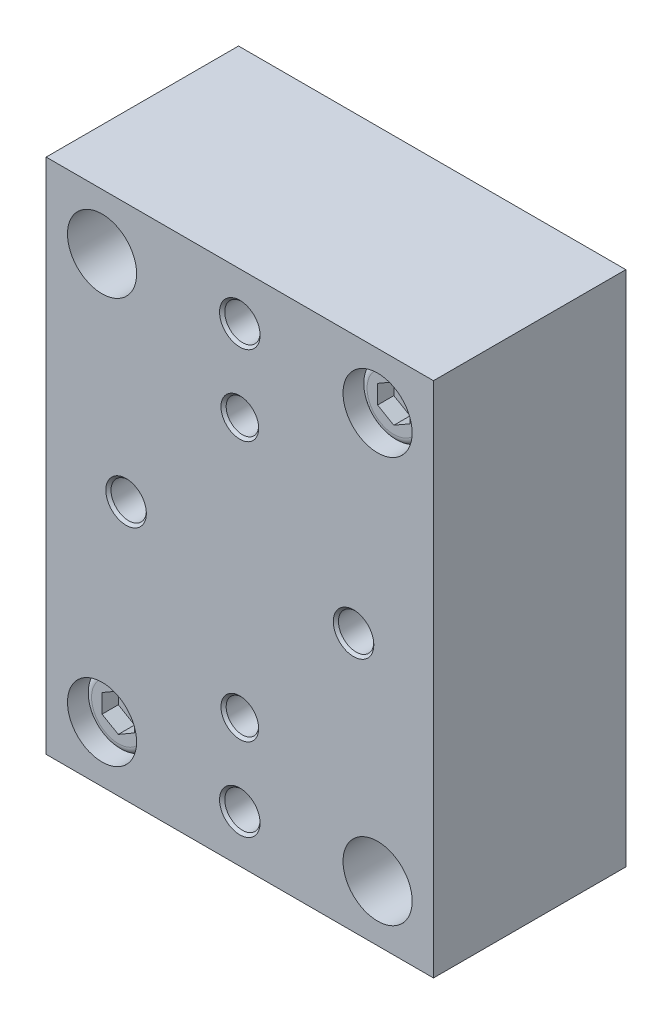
ISO-10303-21;
HEADER;
FILE_DESCRIPTION(('STEP AP214'),'2;1');
FILE_NAME('part.step','',(''),(''),'','','');
FILE_SCHEMA(('AUTOMOTIVE_DESIGN { 1 0 10303 214 1 1 1 1 }'));
ENDSEC;
DATA;
#1=APPLICATION_CONTEXT('core data for automotive mechanical design processes');
#2=APPLICATION_PROTOCOL_DEFINITION('international standard','automotive_design',2000,#1);
#3=PRODUCT_CONTEXT('',#1,'mechanical');
#4=PRODUCT('Part','Part','',(#3));
#5=PRODUCT_RELATED_PRODUCT_CATEGORY('part','',(#4));
#6=PRODUCT_DEFINITION_FORMATION('','',#4);
#7=PRODUCT_DEFINITION_CONTEXT('part definition',#1,'design');
#8=PRODUCT_DEFINITION('design','',#6,#7);
#9=PRODUCT_DEFINITION_SHAPE('','',#8);
#10=(LENGTH_UNIT() NAMED_UNIT(*) SI_UNIT(.MILLI.,.METRE.));
#11=(NAMED_UNIT(*) PLANE_ANGLE_UNIT() SI_UNIT($,.RADIAN.));
#12=(NAMED_UNIT(*) SI_UNIT($,.STERADIAN.) SOLID_ANGLE_UNIT());
#13=UNCERTAINTY_MEASURE_WITH_UNIT(LENGTH_MEASURE(1.E-05),#10,'distance_accuracy_value','');
#14=(GEOMETRIC_REPRESENTATION_CONTEXT(3) GLOBAL_UNCERTAINTY_ASSIGNED_CONTEXT((#13)) GLOBAL_UNIT_ASSIGNED_CONTEXT((#10,
#11,#12)) REPRESENTATION_CONTEXT('',''));
#15=CARTESIAN_POINT('',(0.,0.,0.));
#16=DIRECTION('',(0.,0.,1.));
#17=DIRECTION('',(1.,0.,0.));
#18=AXIS2_PLACEMENT_3D('',#15,#16,#17);
#19=CARTESIAN_POINT('',(-18.923,-25.273,17.2085));
#20=DIRECTION('',(0.,0.,1.));
#21=DIRECTION('',(1.,0.,0.));
#22=AXIS2_PLACEMENT_3D('',#19,#20,#21);
#23=PLANE('',#22);
#24=DIRECTION('',(-0.866025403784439,0.5,0.));
#25=VECTOR('',#24,1.);
#26=CARTESIAN_POINT('',(-11.8745,-18.8954564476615,17.2085));
#27=LINE('',#26,#25);
#28=CARTESIAN_POINT('',(-11.8745,-18.8954564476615,17.2085));
#29=VERTEX_POINT('',#28);
#30=CARTESIAN_POINT('',(-13.462,-17.9789128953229,17.2085));
#31=VERTEX_POINT('',#30);
#32=EDGE_CURVE('E61',#29,#31,#27,.T.);
#33=ORIENTED_EDGE('',*,*,#32,.F.);
#34=DIRECTION('',(0.,1.,0.));
#35=VECTOR('',#34,1.);
#36=CARTESIAN_POINT('',(-11.8745,-20.7285435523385,17.2085));
#37=LINE('',#36,#35);
#38=CARTESIAN_POINT('',(-11.8745,-20.7285435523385,17.2085));
#39=VERTEX_POINT('',#38);
#40=EDGE_CURVE('E144',#39,#29,#37,.T.);
#41=ORIENTED_EDGE('',*,*,#40,.F.);
#42=DIRECTION('',(0.866025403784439,0.5,0.));
#43=VECTOR('',#42,1.);
#44=CARTESIAN_POINT('',(-13.462,-21.6450871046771,17.2085));
#45=LINE('',#44,#43);
#46=CARTESIAN_POINT('',(-13.462,-21.6450871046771,17.2085));
#47=VERTEX_POINT('',#46);
#48=EDGE_CURVE('E142',#47,#39,#45,.T.);
#49=ORIENTED_EDGE('',*,*,#48,.F.);
#50=DIRECTION('',(0.866025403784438,-0.5,0.));
#51=VECTOR('',#50,1.);
#52=CARTESIAN_POINT('',(-15.0495,-20.7285435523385,17.2085));
#53=LINE('',#52,#51);
#54=CARTESIAN_POINT('',(-15.0495,-20.7285435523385,17.2085));
#55=VERTEX_POINT('',#54);
#56=EDGE_CURVE('E109',#55,#47,#53,.T.);
#57=ORIENTED_EDGE('',*,*,#56,.F.);
#58=DIRECTION('',(0.,-1.,0.));
#59=VECTOR('',#58,1.);
#60=CARTESIAN_POINT('',(-15.0495,-18.8954564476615,17.2085));
#61=LINE('',#60,#59);
#62=CARTESIAN_POINT('',(-15.0495,-18.8954564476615,17.2085));
#63=VERTEX_POINT('',#62);
#64=EDGE_CURVE('E138',#63,#55,#61,.T.);
#65=ORIENTED_EDGE('',*,*,#64,.F.);
#66=DIRECTION('',(-0.866025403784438,-0.5,0.));
#67=VECTOR('',#66,1.);
#68=CARTESIAN_POINT('',(-13.462,-17.9789128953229,17.2085));
#69=LINE('',#68,#67);
#70=EDGE_CURVE('E135',#31,#63,#69,.T.);
#71=ORIENTED_EDGE('',*,*,#70,.F.);
#72=EDGE_LOOP('',(#33,#41,#49,#57,#65,#71));
#73=FACE_BOUND('',#72,.T.);
#74=CARTESIAN_POINT('',(-13.462,-19.812,17.2085));
#75=DIRECTION('',(0.,0.,1.));
#76=DIRECTION('',(1.,0.,0.));
#77=AXIS2_PLACEMENT_3D('',#74,#75,#76);
#78=CIRCLE('',#77,2.6162);
#79=CARTESIAN_POINT('',(-10.8458,-19.812,17.2085));
#80=VERTEX_POINT('',#79);
#81=EDGE_CURVE('E12',#80,#80,#78,.T.);
#82=ORIENTED_EDGE('',*,*,#81,.T.);
#83=EDGE_LOOP('',(#82));
#84=FACE_BOUND('',#83,.T.);
#85=ADVANCED_FACE('F46',(#73,#84),#23,.T.);
#86=CARTESIAN_POINT('',(-13.462,-19.812,0.));
#87=DIRECTION('',(0.,0.,-1.));
#88=DIRECTION('',(-1.,0.,0.));
#89=AXIS2_PLACEMENT_3D('',#86,#87,#88);
#90=PLANE('',#89);
#91=CARTESIAN_POINT('',(-13.462,-19.812,0.));
#92=DIRECTION('',(0.,0.,-1.));
#93=DIRECTION('',(-1.,0.,0.));
#94=AXIS2_PLACEMENT_3D('',#91,#92,#93);
#95=CIRCLE('',#94,3.3782);
#96=CARTESIAN_POINT('',(-16.8402,-19.812,0.));
#97=VERTEX_POINT('',#96);
#98=EDGE_CURVE('E148',#97,#97,#95,.T.);
#99=ORIENTED_EDGE('',*,*,#98,.T.);
#100=EDGE_LOOP('',(#99));
#101=FACE_BOUND('',#100,.T.);
#102=ADVANCED_FACE('F170',(#101),#90,.T.);
#103=CARTESIAN_POINT('',(-13.462,-19.812,28.3509925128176));
#104=DIRECTION('',(0.,0.,-1.));
#105=DIRECTION('',(-1.,0.,0.));
#106=AXIS2_PLACEMENT_3D('',#103,#104,#105);
#107=CYLINDRICAL_SURFACE('',#106,3.3782);
#108=CARTESIAN_POINT('',(-13.462,-19.812,16.4465));
#109=DIRECTION('',(0.,0.,1.));
#110=DIRECTION('',(1.,0.,0.));
#111=AXIS2_PLACEMENT_3D('',#108,#109,#110);
#112=CIRCLE('',#111,3.3782);
#113=CARTESIAN_POINT('',(-10.0838,-19.812,16.4465));
#114=VERTEX_POINT('',#113);
#115=EDGE_CURVE('E54',#114,#114,#112,.F.);
#116=ORIENTED_EDGE('',*,*,#115,.T.);
#117=EDGE_LOOP('',(#116));
#118=FACE_BOUND('',#117,.T.);
#119=ORIENTED_EDGE('',*,*,#98,.F.);
#120=EDGE_LOOP('',(#119));
#121=FACE_BOUND('',#120,.T.);
#122=ADVANCED_FACE('F158',(#118,#121),#107,.T.);
#123=CARTESIAN_POINT('',(-13.462,-19.812,16.4465));
#124=DIRECTION('',(0.,0.,1.));
#125=DIRECTION('',(1.,0.,0.));
#126=AXIS2_PLACEMENT_3D('',#123,#124,#125);
#127=TOROIDAL_SURFACE('',#126,2.6162,0.762);
#128=ORIENTED_EDGE('',*,*,#81,.F.);
#129=EDGE_LOOP('',(#128));
#130=FACE_BOUND('',#129,.T.);
#131=ORIENTED_EDGE('',*,*,#115,.F.);
#132=EDGE_LOOP('',(#131));
#133=FACE_BOUND('',#132,.T.);
#134=ADVANCED_FACE('F48',(#130,#133),#127,.T.);
#135=CARTESIAN_POINT('',(-11.8745,-18.8954564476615,15.621));
#136=DIRECTION('',(0.5,0.866025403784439,0.));
#137=DIRECTION('',(-0.866025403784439,0.5,0.));
#138=AXIS2_PLACEMENT_3D('',#135,#136,#137);
#139=PLANE('',#138);
#140=ORIENTED_EDGE('',*,*,#32,.T.);
#141=DIRECTION('',(0.,0.,1.));
#142=VECTOR('',#141,1.);
#143=CARTESIAN_POINT('',(-13.462,-17.9789128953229,15.621));
#144=LINE('',#143,#142);
#145=CARTESIAN_POINT('',(-13.462,-17.9789128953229,15.621));
#146=VERTEX_POINT('',#145);
#147=EDGE_CURVE('E91',#146,#31,#144,.T.);
#148=ORIENTED_EDGE('',*,*,#147,.F.);
#149=DIRECTION('',(-0.866025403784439,0.5,0.));
#150=VECTOR('',#149,1.);
#151=CARTESIAN_POINT('',(-11.8745,-18.8954564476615,15.621));
#152=LINE('',#151,#150);
#153=CARTESIAN_POINT('',(-11.8745,-18.8954564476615,15.621));
#154=VERTEX_POINT('',#153);
#155=EDGE_CURVE('E146',#154,#146,#152,.T.);
#156=ORIENTED_EDGE('',*,*,#155,.F.);
#157=DIRECTION('',(0.,0.,1.));
#158=VECTOR('',#157,1.);
#159=CARTESIAN_POINT('',(-11.8745,-18.8954564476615,15.621));
#160=LINE('',#159,#158);
#161=EDGE_CURVE('E69',#154,#29,#160,.T.);
#162=ORIENTED_EDGE('',*,*,#161,.T.);
#163=EDGE_LOOP('',(#140,#148,#156,#162));
#164=FACE_BOUND('',#163,.T.);
#165=ADVANCED_FACE('F162',(#164),#139,.F.);
#166=CARTESIAN_POINT('',(-11.8745,-20.7285435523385,15.621));
#167=DIRECTION('',(1.,0.,0.));
#168=DIRECTION('',(0.,0.,-1.));
#169=AXIS2_PLACEMENT_3D('',#166,#167,#168);
#170=PLANE('',#169);
#171=ORIENTED_EDGE('',*,*,#40,.T.);
#172=ORIENTED_EDGE('',*,*,#161,.F.);
#173=DIRECTION('',(0.,1.,0.));
#174=VECTOR('',#173,1.);
#175=CARTESIAN_POINT('',(-11.8745,-20.7285435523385,15.621));
#176=LINE('',#175,#174);
#177=CARTESIAN_POINT('',(-11.8745,-20.7285435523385,15.621));
#178=VERTEX_POINT('',#177);
#179=EDGE_CURVE('E121',#178,#154,#176,.T.);
#180=ORIENTED_EDGE('',*,*,#179,.F.);
#181=DIRECTION('',(0.,0.,1.));
#182=VECTOR('',#181,1.);
#183=CARTESIAN_POINT('',(-11.8745,-20.7285435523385,15.621));
#184=LINE('',#183,#182);
#185=EDGE_CURVE('E113',#178,#39,#184,.T.);
#186=ORIENTED_EDGE('',*,*,#185,.T.);
#187=EDGE_LOOP('',(#171,#172,#180,#186));
#188=FACE_BOUND('',#187,.T.);
#189=ADVANCED_FACE('F168',(#188),#170,.F.);
#190=CARTESIAN_POINT('',(-13.462,-21.6450871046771,15.621));
#191=DIRECTION('',(0.5,-0.866025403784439,0.));
#192=DIRECTION('',(0.866025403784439,0.5,0.));
#193=AXIS2_PLACEMENT_3D('',#190,#191,#192);
#194=PLANE('',#193);
#195=ORIENTED_EDGE('',*,*,#48,.T.);
#196=ORIENTED_EDGE('',*,*,#185,.F.);
#197=DIRECTION('',(0.866025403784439,0.5,0.));
#198=VECTOR('',#197,1.);
#199=CARTESIAN_POINT('',(-13.462,-21.6450871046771,15.621));
#200=LINE('',#199,#198);
#201=CARTESIAN_POINT('',(-13.462,-21.6450871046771,15.621));
#202=VERTEX_POINT('',#201);
#203=EDGE_CURVE('E117',#202,#178,#200,.T.);
#204=ORIENTED_EDGE('',*,*,#203,.F.);
#205=DIRECTION('',(0.,0.,1.));
#206=VECTOR('',#205,1.);
#207=CARTESIAN_POINT('',(-13.462,-21.6450871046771,15.621));
#208=LINE('',#207,#206);
#209=EDGE_CURVE('E102',#202,#47,#208,.T.);
#210=ORIENTED_EDGE('',*,*,#209,.T.);
#211=EDGE_LOOP('',(#195,#196,#204,#210));
#212=FACE_BOUND('',#211,.T.);
#213=ADVANCED_FACE('F118',(#212),#194,.F.);
#214=CARTESIAN_POINT('',(-15.0495,-20.7285435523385,15.621));
#215=DIRECTION('',(-0.5,-0.866025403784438,0.));
#216=DIRECTION('',(0.866025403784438,-0.5,0.));
#217=AXIS2_PLACEMENT_3D('',#214,#215,#216);
#218=PLANE('',#217);
#219=ORIENTED_EDGE('',*,*,#56,.T.);
#220=ORIENTED_EDGE('',*,*,#209,.F.);
#221=DIRECTION('',(0.866025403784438,-0.5,0.));
#222=VECTOR('',#221,1.);
#223=CARTESIAN_POINT('',(-15.0495,-20.7285435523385,15.621));
#224=LINE('',#223,#222);
#225=CARTESIAN_POINT('',(-15.0495,-20.7285435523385,15.621));
#226=VERTEX_POINT('',#225);
#227=EDGE_CURVE('E106',#226,#202,#224,.T.);
#228=ORIENTED_EDGE('',*,*,#227,.F.);
#229=DIRECTION('',(0.,0.,1.));
#230=VECTOR('',#229,1.);
#231=CARTESIAN_POINT('',(-15.0495,-20.7285435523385,15.621));
#232=LINE('',#231,#230);
#233=EDGE_CURVE('E114',#226,#55,#232,.T.);
#234=ORIENTED_EDGE('',*,*,#233,.T.);
#235=EDGE_LOOP('',(#219,#220,#228,#234));
#236=FACE_BOUND('',#235,.T.);
#237=ADVANCED_FACE('F104',(#236),#218,.F.);
#238=CARTESIAN_POINT('',(-15.0495,-18.8954564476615,15.621));
#239=DIRECTION('',(-1.,0.,0.));
#240=DIRECTION('',(0.,0.,1.));
#241=AXIS2_PLACEMENT_3D('',#238,#239,#240);
#242=PLANE('',#241);
#243=ORIENTED_EDGE('',*,*,#64,.T.);
#244=ORIENTED_EDGE('',*,*,#233,.F.);
#245=DIRECTION('',(0.,-1.,0.));
#246=VECTOR('',#245,1.);
#247=CARTESIAN_POINT('',(-15.0495,-18.8954564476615,15.621));
#248=LINE('',#247,#246);
#249=CARTESIAN_POINT('',(-15.0495,-18.8954564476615,15.621));
#250=VERTEX_POINT('',#249);
#251=EDGE_CURVE('E127',#250,#226,#248,.T.);
#252=ORIENTED_EDGE('',*,*,#251,.F.);
#253=DIRECTION('',(0.,0.,1.));
#254=VECTOR('',#253,1.);
#255=CARTESIAN_POINT('',(-15.0495,-18.8954564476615,15.621));
#256=LINE('',#255,#254);
#257=EDGE_CURVE('E151',#250,#63,#256,.T.);
#258=ORIENTED_EDGE('',*,*,#257,.T.);
#259=EDGE_LOOP('',(#243,#244,#252,#258));
#260=FACE_BOUND('',#259,.T.);
#261=ADVANCED_FACE('F185',(#260),#242,.F.);
#262=CARTESIAN_POINT('',(-13.462,-17.9789128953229,15.621));
#263=DIRECTION('',(-0.5,0.866025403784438,0.));
#264=DIRECTION('',(-0.866025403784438,-0.5,0.));
#265=AXIS2_PLACEMENT_3D('',#262,#263,#264);
#266=PLANE('',#265);
#267=ORIENTED_EDGE('',*,*,#70,.T.);
#268=ORIENTED_EDGE('',*,*,#257,.F.);
#269=DIRECTION('',(-0.866025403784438,-0.5,0.));
#270=VECTOR('',#269,1.);
#271=CARTESIAN_POINT('',(-13.462,-17.9789128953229,15.621));
#272=LINE('',#271,#270);
#273=EDGE_CURVE('E129',#146,#250,#272,.T.);
#274=ORIENTED_EDGE('',*,*,#273,.F.);
#275=ORIENTED_EDGE('',*,*,#147,.T.);
#276=EDGE_LOOP('',(#267,#268,#274,#275));
#277=FACE_BOUND('',#276,.T.);
#278=ADVANCED_FACE('F182',(#277),#266,.F.);
#279=CARTESIAN_POINT('',(0.,0.,15.621));
#280=DIRECTION('',(0.,0.,1.));
#281=DIRECTION('',(1.,0.,0.));
#282=AXIS2_PLACEMENT_3D('',#279,#280,#281);
#283=PLANE('',#282);
#284=ORIENTED_EDGE('',*,*,#155,.T.);
#285=ORIENTED_EDGE('',*,*,#273,.T.);
#286=ORIENTED_EDGE('',*,*,#251,.T.);
#287=ORIENTED_EDGE('',*,*,#227,.T.);
#288=ORIENTED_EDGE('',*,*,#203,.T.);
#289=ORIENTED_EDGE('',*,*,#179,.T.);
#290=EDGE_LOOP('',(#284,#285,#286,#287,#288,#289));
#291=FACE_BOUND('',#290,.T.);
#292=ADVANCED_FACE('F124',(#291),#283,.T.);
#293=CLOSED_SHELL('',(#85,#102,#122,#134,#165,#189,#213,#237,#261,#278,#292));
#294=MANIFOLD_SOLID_BREP('B2',#293);
#295=CARTESIAN_POINT('',(-18.923,-25.273,17.2085));
#296=DIRECTION('',(0.,0.,1.));
#297=DIRECTION('',(1.,0.,0.));
#298=AXIS2_PLACEMENT_3D('',#295,#296,#297);
#299=PLANE('',#298);
#300=DIRECTION('',(-0.866025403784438,0.5,0.));
#301=VECTOR('',#300,1.);
#302=CARTESIAN_POINT('',(15.0495,20.7285435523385,17.2085));
#303=LINE('',#302,#301);
#304=CARTESIAN_POINT('',(15.0495,20.7285435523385,17.2085));
#305=VERTEX_POINT('',#304);
#306=CARTESIAN_POINT('',(13.462,21.6450871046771,17.2085));
#307=VERTEX_POINT('',#306);
#308=EDGE_CURVE('E292',#305,#307,#303,.T.);
#309=ORIENTED_EDGE('',*,*,#308,.F.);
#310=DIRECTION('',(0.,1.,0.));
#311=VECTOR('',#310,1.);
#312=CARTESIAN_POINT('',(15.0495,18.8954564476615,17.2085));
#313=LINE('',#312,#311);
#314=CARTESIAN_POINT('',(15.0495,18.8954564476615,17.2085));
#315=VERTEX_POINT('',#314);
#316=EDGE_CURVE('E375',#315,#305,#313,.T.);
#317=ORIENTED_EDGE('',*,*,#316,.F.);
#318=DIRECTION('',(0.866025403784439,0.499999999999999,0.));
#319=VECTOR('',#318,1.);
#320=CARTESIAN_POINT('',(13.462,17.9789128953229,17.2085));
#321=LINE('',#320,#319);
#322=CARTESIAN_POINT('',(13.462,17.9789128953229,17.2085));
#323=VERTEX_POINT('',#322);
#324=EDGE_CURVE('E373',#323,#315,#321,.T.);
#325=ORIENTED_EDGE('',*,*,#324,.F.);
#326=DIRECTION('',(0.866025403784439,-0.499999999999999,0.));
#327=VECTOR('',#326,1.);
#328=CARTESIAN_POINT('',(11.8745,18.8954564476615,17.2085));
#329=LINE('',#328,#327);
#330=CARTESIAN_POINT('',(11.8745,18.8954564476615,17.2085));
#331=VERTEX_POINT('',#330);
#332=EDGE_CURVE('E340',#331,#323,#329,.T.);
#333=ORIENTED_EDGE('',*,*,#332,.F.);
#334=DIRECTION('',(0.,-1.,0.));
#335=VECTOR('',#334,1.);
#336=CARTESIAN_POINT('',(11.8745,20.7285435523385,17.2085));
#337=LINE('',#336,#335);
#338=CARTESIAN_POINT('',(11.8745,20.7285435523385,17.2085));
#339=VERTEX_POINT('',#338);
#340=EDGE_CURVE('E369',#339,#331,#337,.T.);
#341=ORIENTED_EDGE('',*,*,#340,.F.);
#342=DIRECTION('',(-0.866025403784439,-0.5,0.));
#343=VECTOR('',#342,1.);
#344=CARTESIAN_POINT('',(13.462,21.6450871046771,17.2085));
#345=LINE('',#344,#343);
#346=EDGE_CURVE('E366',#307,#339,#345,.T.);
#347=ORIENTED_EDGE('',*,*,#346,.F.);
#348=EDGE_LOOP('',(#309,#317,#325,#333,#341,#347));
#349=FACE_BOUND('',#348,.T.);
#350=CARTESIAN_POINT('',(13.462,19.812,17.2085));
#351=DIRECTION('',(0.,0.,1.));
#352=DIRECTION('',(1.,0.,0.));
#353=AXIS2_PLACEMENT_3D('',#350,#351,#352);
#354=CIRCLE('',#353,2.6162);
#355=CARTESIAN_POINT('',(16.0782,19.812,17.2085));
#356=VERTEX_POINT('',#355);
#357=EDGE_CURVE('E44',#356,#356,#354,.T.);
#358=ORIENTED_EDGE('',*,*,#357,.T.);
#359=EDGE_LOOP('',(#358));
#360=FACE_BOUND('',#359,.T.);
#361=ADVANCED_FACE('F277',(#349,#360),#299,.T.);
#362=CARTESIAN_POINT('',(13.462,19.812,0.));
#363=DIRECTION('',(0.,0.,-1.));
#364=DIRECTION('',(-1.,0.,0.));
#365=AXIS2_PLACEMENT_3D('',#362,#363,#364);
#366=PLANE('',#365);
#367=CARTESIAN_POINT('',(13.462,19.812,0.));
#368=DIRECTION('',(0.,0.,-1.));
#369=DIRECTION('',(-1.,0.,0.));
#370=AXIS2_PLACEMENT_3D('',#367,#368,#369);
#371=CIRCLE('',#370,3.3782);
#372=CARTESIAN_POINT('',(10.0838,19.812,0.));
#373=VERTEX_POINT('',#372);
#374=EDGE_CURVE('E379',#373,#373,#371,.T.);
#375=ORIENTED_EDGE('',*,*,#374,.T.);
#376=EDGE_LOOP('',(#375));
#377=FACE_BOUND('',#376,.T.);
#378=ADVANCED_FACE('F401',(#377),#366,.T.);
#379=CARTESIAN_POINT('',(13.462,19.812,28.3509925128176));
#380=DIRECTION('',(0.,0.,-1.));
#381=DIRECTION('',(-1.,0.,0.));
#382=AXIS2_PLACEMENT_3D('',#379,#380,#381);
#383=CYLINDRICAL_SURFACE('',#382,3.3782);
#384=CARTESIAN_POINT('',(13.462,19.812,16.4465));
#385=DIRECTION('',(0.,0.,1.));
#386=DIRECTION('',(1.,0.,0.));
#387=AXIS2_PLACEMENT_3D('',#384,#385,#386);
#388=CIRCLE('',#387,3.3782);
#389=CARTESIAN_POINT('',(16.8402,19.812,16.4465));
#390=VERTEX_POINT('',#389);
#391=EDGE_CURVE('E285',#390,#390,#388,.F.);
#392=ORIENTED_EDGE('',*,*,#391,.T.);
#393=EDGE_LOOP('',(#392));
#394=FACE_BOUND('',#393,.T.);
#395=ORIENTED_EDGE('',*,*,#374,.F.);
#396=EDGE_LOOP('',(#395));
#397=FACE_BOUND('',#396,.T.);
#398=ADVANCED_FACE('F389',(#394,#397),#383,.T.);
#399=CARTESIAN_POINT('',(13.462,19.812,16.4465));
#400=DIRECTION('',(0.,0.,1.));
#401=DIRECTION('',(1.,0.,0.));
#402=AXIS2_PLACEMENT_3D('',#399,#400,#401);
#403=TOROIDAL_SURFACE('',#402,2.6162,0.762);
#404=ORIENTED_EDGE('',*,*,#357,.F.);
#405=EDGE_LOOP('',(#404));
#406=FACE_BOUND('',#405,.T.);
#407=ORIENTED_EDGE('',*,*,#391,.F.);
#408=EDGE_LOOP('',(#407));
#409=FACE_BOUND('',#408,.T.);
#410=ADVANCED_FACE('F279',(#406,#409),#403,.T.);
#411=CARTESIAN_POINT('',(15.0495,20.7285435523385,15.621));
#412=DIRECTION('',(0.5,0.866025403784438,0.));
#413=DIRECTION('',(-0.866025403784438,0.5,0.));
#414=AXIS2_PLACEMENT_3D('',#411,#412,#413);
#415=PLANE('',#414);
#416=ORIENTED_EDGE('',*,*,#308,.T.);
#417=DIRECTION('',(0.,0.,1.));
#418=VECTOR('',#417,1.);
#419=CARTESIAN_POINT('',(13.462,21.6450871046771,15.621));
#420=LINE('',#419,#418);
#421=CARTESIAN_POINT('',(13.462,21.6450871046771,15.621));
#422=VERTEX_POINT('',#421);
#423=EDGE_CURVE('E322',#422,#307,#420,.T.);
#424=ORIENTED_EDGE('',*,*,#423,.F.);
#425=DIRECTION('',(-0.866025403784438,0.5,0.));
#426=VECTOR('',#425,1.);
#427=CARTESIAN_POINT('',(15.0495,20.7285435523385,15.621));
#428=LINE('',#427,#426);
#429=CARTESIAN_POINT('',(15.0495,20.7285435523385,15.621));
#430=VERTEX_POINT('',#429);
#431=EDGE_CURVE('E377',#430,#422,#428,.T.);
#432=ORIENTED_EDGE('',*,*,#431,.F.);
#433=DIRECTION('',(0.,0.,1.));
#434=VECTOR('',#433,1.);
#435=CARTESIAN_POINT('',(15.0495,20.7285435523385,15.621));
#436=LINE('',#435,#434);
#437=EDGE_CURVE('E300',#430,#305,#436,.T.);
#438=ORIENTED_EDGE('',*,*,#437,.T.);
#439=EDGE_LOOP('',(#416,#424,#432,#438));
#440=FACE_BOUND('',#439,.T.);
#441=ADVANCED_FACE('F393',(#440),#415,.F.);
#442=CARTESIAN_POINT('',(15.0495,18.8954564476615,15.621));
#443=DIRECTION('',(1.,0.,0.));
#444=DIRECTION('',(0.,0.,-1.));
#445=AXIS2_PLACEMENT_3D('',#442,#443,#444);
#446=PLANE('',#445);
#447=ORIENTED_EDGE('',*,*,#316,.T.);
#448=ORIENTED_EDGE('',*,*,#437,.F.);
#449=DIRECTION('',(0.,1.,0.));
#450=VECTOR('',#449,1.);
#451=CARTESIAN_POINT('',(15.0495,18.8954564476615,15.621));
#452=LINE('',#451,#450);
#453=CARTESIAN_POINT('',(15.0495,18.8954564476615,15.621));
#454=VERTEX_POINT('',#453);
#455=EDGE_CURVE('E352',#454,#430,#452,.T.);
#456=ORIENTED_EDGE('',*,*,#455,.F.);
#457=DIRECTION('',(0.,0.,1.));
#458=VECTOR('',#457,1.);
#459=CARTESIAN_POINT('',(15.0495,18.8954564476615,15.621));
#460=LINE('',#459,#458);
#461=EDGE_CURVE('E344',#454,#315,#460,.T.);
#462=ORIENTED_EDGE('',*,*,#461,.T.);
#463=EDGE_LOOP('',(#447,#448,#456,#462));
#464=FACE_BOUND('',#463,.T.);
#465=ADVANCED_FACE('F399',(#464),#446,.F.);
#466=CARTESIAN_POINT('',(13.462,17.9789128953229,15.621));
#467=DIRECTION('',(0.499999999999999,-0.866025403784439,0.));
#468=DIRECTION('',(0.86602540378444,0.499999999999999,0.));
#469=AXIS2_PLACEMENT_3D('',#466,#467,#468);
#470=PLANE('',#469);
#471=ORIENTED_EDGE('',*,*,#324,.T.);
#472=ORIENTED_EDGE('',*,*,#461,.F.);
#473=DIRECTION('',(0.866025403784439,0.499999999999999,0.));
#474=VECTOR('',#473,1.);
#475=CARTESIAN_POINT('',(13.462,17.9789128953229,15.621));
#476=LINE('',#475,#474);
#477=CARTESIAN_POINT('',(13.462,17.9789128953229,15.621));
#478=VERTEX_POINT('',#477);
#479=EDGE_CURVE('E348',#478,#454,#476,.T.);
#480=ORIENTED_EDGE('',*,*,#479,.F.);
#481=DIRECTION('',(0.,0.,1.));
#482=VECTOR('',#481,1.);
#483=CARTESIAN_POINT('',(13.462,17.9789128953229,15.621));
#484=LINE('',#483,#482);
#485=EDGE_CURVE('E333',#478,#323,#484,.T.);
#486=ORIENTED_EDGE('',*,*,#485,.T.);
#487=EDGE_LOOP('',(#471,#472,#480,#486));
#488=FACE_BOUND('',#487,.T.);
#489=ADVANCED_FACE('F349',(#488),#470,.F.);
#490=CARTESIAN_POINT('',(11.8745,18.8954564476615,15.621));
#491=DIRECTION('',(-0.499999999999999,-0.866025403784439,0.));
#492=DIRECTION('',(0.866025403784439,-0.499999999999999,0.));
#493=AXIS2_PLACEMENT_3D('',#490,#491,#492);
#494=PLANE('',#493);
#495=ORIENTED_EDGE('',*,*,#332,.T.);
#496=ORIENTED_EDGE('',*,*,#485,.F.);
#497=DIRECTION('',(0.866025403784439,-0.499999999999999,0.));
#498=VECTOR('',#497,1.);
#499=CARTESIAN_POINT('',(11.8745,18.8954564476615,15.621));
#500=LINE('',#499,#498);
#501=CARTESIAN_POINT('',(11.8745,18.8954564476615,15.621));
#502=VERTEX_POINT('',#501);
#503=EDGE_CURVE('E337',#502,#478,#500,.T.);
#504=ORIENTED_EDGE('',*,*,#503,.F.);
#505=DIRECTION('',(0.,0.,1.));
#506=VECTOR('',#505,1.);
#507=CARTESIAN_POINT('',(11.8745,18.8954564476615,15.621));
#508=LINE('',#507,#506);
#509=EDGE_CURVE('E345',#502,#331,#508,.T.);
#510=ORIENTED_EDGE('',*,*,#509,.T.);
#511=EDGE_LOOP('',(#495,#496,#504,#510));
#512=FACE_BOUND('',#511,.T.);
#513=ADVANCED_FACE('F335',(#512),#494,.F.);
#514=CARTESIAN_POINT('',(11.8745,20.7285435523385,15.621));
#515=DIRECTION('',(-1.,0.,0.));
#516=DIRECTION('',(0.,0.,1.));
#517=AXIS2_PLACEMENT_3D('',#514,#515,#516);
#518=PLANE('',#517);
#519=ORIENTED_EDGE('',*,*,#340,.T.);
#520=ORIENTED_EDGE('',*,*,#509,.F.);
#521=DIRECTION('',(0.,-1.,0.));
#522=VECTOR('',#521,1.);
#523=CARTESIAN_POINT('',(11.8745,20.7285435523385,15.621));
#524=LINE('',#523,#522);
#525=CARTESIAN_POINT('',(11.8745,20.7285435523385,15.621));
#526=VERTEX_POINT('',#525);
#527=EDGE_CURVE('E358',#526,#502,#524,.T.);
#528=ORIENTED_EDGE('',*,*,#527,.F.);
#529=DIRECTION('',(0.,0.,1.));
#530=VECTOR('',#529,1.);
#531=CARTESIAN_POINT('',(11.8745,20.7285435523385,15.621));
#532=LINE('',#531,#530);
#533=EDGE_CURVE('E382',#526,#339,#532,.T.);
#534=ORIENTED_EDGE('',*,*,#533,.T.);
#535=EDGE_LOOP('',(#519,#520,#528,#534));
#536=FACE_BOUND('',#535,.T.);
#537=ADVANCED_FACE('F416',(#536),#518,.F.);
#538=CARTESIAN_POINT('',(13.462,21.6450871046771,15.621));
#539=DIRECTION('',(-0.5,0.866025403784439,0.));
#540=DIRECTION('',(-0.866025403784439,-0.5,0.));
#541=AXIS2_PLACEMENT_3D('',#538,#539,#540);
#542=PLANE('',#541);
#543=ORIENTED_EDGE('',*,*,#346,.T.);
#544=ORIENTED_EDGE('',*,*,#533,.F.);
#545=DIRECTION('',(-0.866025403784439,-0.5,0.));
#546=VECTOR('',#545,1.);
#547=CARTESIAN_POINT('',(13.462,21.6450871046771,15.621));
#548=LINE('',#547,#546);
#549=EDGE_CURVE('E360',#422,#526,#548,.T.);
#550=ORIENTED_EDGE('',*,*,#549,.F.);
#551=ORIENTED_EDGE('',*,*,#423,.T.);
#552=EDGE_LOOP('',(#543,#544,#550,#551));
#553=FACE_BOUND('',#552,.T.);
#554=ADVANCED_FACE('F413',(#553),#542,.F.);
#555=CARTESIAN_POINT('',(0.,0.,15.621));
#556=DIRECTION('',(0.,0.,1.));
#557=DIRECTION('',(1.,0.,0.));
#558=AXIS2_PLACEMENT_3D('',#555,#556,#557);
#559=PLANE('',#558);
#560=ORIENTED_EDGE('',*,*,#431,.T.);
#561=ORIENTED_EDGE('',*,*,#549,.T.);
#562=ORIENTED_EDGE('',*,*,#527,.T.);
#563=ORIENTED_EDGE('',*,*,#503,.T.);
#564=ORIENTED_EDGE('',*,*,#479,.T.);
#565=ORIENTED_EDGE('',*,*,#455,.T.);
#566=EDGE_LOOP('',(#560,#561,#562,#563,#564,#565));
#567=FACE_BOUND('',#566,.T.);
#568=ADVANCED_FACE('F355',(#567),#559,.T.);
#569=CLOSED_SHELL('',(#361,#378,#398,#410,#441,#465,#489,#513,#537,#554,#568));
#570=MANIFOLD_SOLID_BREP('B6',#569);
#571=CARTESIAN_POINT('',(-18.923,-25.273,0.));
#572=DIRECTION('',(0.,0.,1.));
#573=DIRECTION('',(1.,0.,0.));
#574=AXIS2_PLACEMENT_3D('',#571,#572,#573);
#575=PLANE('',#574);
#576=CARTESIAN_POINT('',(-11.1125,0.,0.));
#577=DIRECTION('',(0.,0.,1.));
#578=DIRECTION('',(1.,0.,0.));
#579=AXIS2_PLACEMENT_3D('',#576,#577,#578);
#580=CIRCLE('',#579,1.7272);
#581=CARTESIAN_POINT('',(-9.3853,0.,0.));
#582=VERTEX_POINT('',#581);
#583=EDGE_CURVE('E801',#582,#582,#580,.T.);
#584=ORIENTED_EDGE('',*,*,#583,.T.);
#585=EDGE_LOOP('',(#584));
#586=FACE_BOUND('',#585,.T.);
#587=CARTESIAN_POINT('',(11.1125,0.,0.));
#588=DIRECTION('',(0.,0.,1.));
#589=DIRECTION('',(1.,0.,0.));
#590=AXIS2_PLACEMENT_3D('',#587,#588,#589);
#591=CIRCLE('',#590,1.7272);
#592=CARTESIAN_POINT('',(12.8397,0.,0.));
#593=VERTEX_POINT('',#592);
#594=EDGE_CURVE('E683',#593,#593,#591,.T.);
#595=ORIENTED_EDGE('',*,*,#594,.T.);
#596=EDGE_LOOP('',(#595));
#597=FACE_BOUND('',#596,.T.);
#598=CARTESIAN_POINT('',(0.,20.6375,0.));
#599=DIRECTION('',(0.,0.,1.));
#600=DIRECTION('',(1.,0.,0.));
#601=AXIS2_PLACEMENT_3D('',#598,#599,#600);
#602=CIRCLE('',#601,1.7272);
#603=CARTESIAN_POINT('',(1.72719999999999,20.6375,0.));
#604=VERTEX_POINT('',#603);
#605=EDGE_CURVE('E677',#604,#604,#602,.T.);
#606=ORIENTED_EDGE('',*,*,#605,.T.);
#607=EDGE_LOOP('',(#606));
#608=FACE_BOUND('',#607,.T.);
#609=CARTESIAN_POINT('',(0.,-20.6375,0.));
#610=DIRECTION('',(0.,0.,1.));
#611=DIRECTION('',(1.,0.,0.));
#612=AXIS2_PLACEMENT_3D('',#609,#610,#611);
#613=CIRCLE('',#612,1.7272);
#614=CARTESIAN_POINT('',(1.72719999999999,-20.6375,0.));
#615=VERTEX_POINT('',#614);
#616=EDGE_CURVE('E674',#615,#615,#613,.T.);
#617=ORIENTED_EDGE('',*,*,#616,.T.);
#618=EDGE_LOOP('',(#617));
#619=FACE_BOUND('',#618,.T.);
#620=CARTESIAN_POINT('',(0.,12.7,0.));
#621=DIRECTION('',(0.,0.,-1.));
#622=DIRECTION('',(-1.,0.,0.));
#623=AXIS2_PLACEMENT_3D('',#620,#621,#622);
#624=CIRCLE('',#623,2.98450000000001);
#625=CARTESIAN_POINT('',(-2.98450000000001,12.7,0.));
#626=VERTEX_POINT('',#625);
#627=EDGE_CURVE('E676',#626,#626,#624,.T.);
#628=ORIENTED_EDGE('',*,*,#627,.F.);
#629=EDGE_LOOP('',(#628));
#630=FACE_BOUND('',#629,.T.);
#631=DIRECTION('',(0.,-1.,0.));
#632=VECTOR('',#631,1.);
#633=CARTESIAN_POINT('',(-18.923,25.273,0.));
#634=LINE('',#633,#632);
#635=CARTESIAN_POINT('',(-18.923,25.273,0.));
#636=VERTEX_POINT('',#635);
#637=CARTESIAN_POINT('',(-18.923,-25.273,0.));
#638=VERTEX_POINT('',#637);
#639=EDGE_CURVE('E568',#636,#638,#634,.T.);
#640=ORIENTED_EDGE('',*,*,#639,.F.);
#641=DIRECTION('',(-1.,0.,0.));
#642=VECTOR('',#641,1.);
#643=CARTESIAN_POINT('',(-18.923,25.273,0.));
#644=LINE('',#643,#642);
#645=CARTESIAN_POINT('',(18.923,25.273,0.));
#646=VERTEX_POINT('',#645);
#647=EDGE_CURVE('E539',#646,#636,#644,.T.);
#648=ORIENTED_EDGE('',*,*,#647,.F.);
#649=DIRECTION('',(0.,1.,0.));
#650=VECTOR('',#649,1.);
#651=CARTESIAN_POINT('',(18.923,25.273,0.));
#652=LINE('',#651,#650);
#653=CARTESIAN_POINT('',(18.923,-25.273,0.));
#654=VERTEX_POINT('',#653);
#655=EDGE_CURVE('E533',#654,#646,#652,.T.);
#656=ORIENTED_EDGE('',*,*,#655,.F.);
#657=DIRECTION('',(1.,0.,0.));
#658=VECTOR('',#657,1.);
#659=CARTESIAN_POINT('',(-18.923,-25.273,0.));
#660=LINE('',#659,#658);
#661=EDGE_CURVE('E558',#638,#654,#660,.T.);
#662=ORIENTED_EDGE('',*,*,#661,.F.);
#663=EDGE_LOOP('',(#640,#648,#656,#662));
#664=FACE_BOUND('',#663,.T.);
#665=CARTESIAN_POINT('',(-13.462,19.812,0.));
#666=DIRECTION('',(0.,0.,1.));
#667=DIRECTION('',(1.,0.,0.));
#668=AXIS2_PLACEMENT_3D('',#665,#666,#667);
#669=CIRCLE('',#668,3.3782);
#670=CARTESIAN_POINT('',(-10.0838,19.812,0.));
#671=VERTEX_POINT('',#670);
#672=EDGE_CURVE('E571',#671,#671,#669,.T.);
#673=ORIENTED_EDGE('',*,*,#672,.T.);
#674=EDGE_LOOP('',(#673));
#675=FACE_BOUND('',#674,.T.);
#676=CARTESIAN_POINT('',(13.462,19.812,0.));
#677=DIRECTION('',(0.,0.,1.));
#678=DIRECTION('',(1.,0.,0.));
#679=AXIS2_PLACEMENT_3D('',#676,#677,#678);
#680=CIRCLE('',#679,3.3782);
#681=CARTESIAN_POINT('',(16.8402,19.812,0.));
#682=VERTEX_POINT('',#681);
#683=EDGE_CURVE('E714',#682,#682,#680,.T.);
#684=ORIENTED_EDGE('',*,*,#683,.T.);
#685=EDGE_LOOP('',(#684));
#686=FACE_BOUND('',#685,.T.);
#687=CARTESIAN_POINT('',(-13.462,-19.812,0.));
#688=DIRECTION('',(0.,0.,1.));
#689=DIRECTION('',(1.,0.,0.));
#690=AXIS2_PLACEMENT_3D('',#687,#688,#689);
#691=CIRCLE('',#690,3.3782);
#692=CARTESIAN_POINT('',(-10.0838,-19.812,0.));
#693=VERTEX_POINT('',#692);
#694=EDGE_CURVE('E708',#693,#693,#691,.T.);
#695=ORIENTED_EDGE('',*,*,#694,.T.);
#696=EDGE_LOOP('',(#695));
#697=FACE_BOUND('',#696,.T.);
#698=CARTESIAN_POINT('',(13.462,-19.812,0.));
#699=DIRECTION('',(0.,0.,1.));
#700=DIRECTION('',(1.,0.,0.));
#701=AXIS2_PLACEMENT_3D('',#698,#699,#700);
#702=CIRCLE('',#701,3.3782);
#703=CARTESIAN_POINT('',(16.8402,-19.812,0.));
#704=VERTEX_POINT('',#703);
#705=EDGE_CURVE('E702',#704,#704,#702,.T.);
#706=ORIENTED_EDGE('',*,*,#705,.T.);
#707=EDGE_LOOP('',(#706));
#708=FACE_BOUND('',#707,.T.);
#709=CARTESIAN_POINT('',(0.,-12.7,0.));
#710=DIRECTION('',(0.,0.,-1.));
#711=DIRECTION('',(-1.,0.,0.));
#712=AXIS2_PLACEMENT_3D('',#709,#710,#711);
#713=CIRCLE('',#712,2.98450000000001);
#714=CARTESIAN_POINT('',(-2.98450000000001,-12.7,0.));
#715=VERTEX_POINT('',#714);
#716=EDGE_CURVE('E692',#715,#715,#713,.T.);
#717=ORIENTED_EDGE('',*,*,#716,.F.);
#718=EDGE_LOOP('',(#717));
#719=FACE_BOUND('',#718,.T.);
#720=ADVANCED_FACE('F499',(#586,#597,#608,#619,#630,#664,#675,#686,#697,#708,#719),#575,.F.);
#721=CARTESIAN_POINT('',(-18.923,-25.273,18.796));
#722=DIRECTION('',(0.,0.,1.));
#723=DIRECTION('',(1.,0.,0.));
#724=AXIS2_PLACEMENT_3D('',#721,#722,#723);
#725=PLANE('',#724);
#726=CARTESIAN_POINT('',(-11.1125,0.,18.796));
#727=DIRECTION('',(0.,0.,1.));
#728=DIRECTION('',(1.,0.,0.));
#729=AXIS2_PLACEMENT_3D('',#726,#727,#728);
#730=CIRCLE('',#729,1.98119999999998);
#731=CARTESIAN_POINT('',(-9.13130000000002,0.,18.796));
#732=VERTEX_POINT('',#731);
#733=EDGE_CURVE('E596',#732,#732,#730,.F.);
#734=ORIENTED_EDGE('',*,*,#733,.T.);
#735=EDGE_LOOP('',(#734));
#736=FACE_BOUND('',#735,.T.);
#737=CARTESIAN_POINT('',(11.1125,0.,18.796));
#738=DIRECTION('',(0.,0.,1.));
#739=DIRECTION('',(1.,0.,0.));
#740=AXIS2_PLACEMENT_3D('',#737,#738,#739);
#741=CIRCLE('',#740,1.98119999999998);
#742=CARTESIAN_POINT('',(13.0937,0.,18.796));
#743=VERTEX_POINT('',#742);
#744=EDGE_CURVE('E593',#743,#743,#741,.F.);
#745=ORIENTED_EDGE('',*,*,#744,.T.);
#746=EDGE_LOOP('',(#745));
#747=FACE_BOUND('',#746,.T.);
#748=CARTESIAN_POINT('',(0.,-20.6375,18.796));
#749=DIRECTION('',(0.,0.,1.));
#750=DIRECTION('',(1.,0.,0.));
#751=AXIS2_PLACEMENT_3D('',#748,#749,#750);
#752=CIRCLE('',#751,1.98119999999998);
#753=CARTESIAN_POINT('',(1.98119999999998,-20.6375,18.796));
#754=VERTEX_POINT('',#753);
#755=EDGE_CURVE('E590',#754,#754,#752,.F.);
#756=ORIENTED_EDGE('',*,*,#755,.T.);
#757=EDGE_LOOP('',(#756));
#758=FACE_BOUND('',#757,.T.);
#759=CARTESIAN_POINT('',(0.,-12.7,18.796));
#760=DIRECTION('',(0.,0.,1.));
#761=DIRECTION('',(1.,0.,0.));
#762=AXIS2_PLACEMENT_3D('',#759,#760,#761);
#763=CIRCLE('',#762,1.84150000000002);
#764=CARTESIAN_POINT('',(1.84150000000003,-12.7,18.796));
#765=VERTEX_POINT('',#764);
#766=EDGE_CURVE('E587',#765,#765,#763,.F.);
#767=ORIENTED_EDGE('',*,*,#766,.T.);
#768=EDGE_LOOP('',(#767));
#769=FACE_BOUND('',#768,.T.);
#770=CARTESIAN_POINT('',(0.,20.6375,18.796));
#771=DIRECTION('',(0.,0.,1.));
#772=DIRECTION('',(1.,0.,0.));
#773=AXIS2_PLACEMENT_3D('',#770,#771,#772);
#774=CIRCLE('',#773,1.98119999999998);
#775=CARTESIAN_POINT('',(1.98119999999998,20.6375,18.796));
#776=VERTEX_POINT('',#775);
#777=EDGE_CURVE('E584',#776,#776,#774,.F.);
#778=ORIENTED_EDGE('',*,*,#777,.T.);
#779=EDGE_LOOP('',(#778));
#780=FACE_BOUND('',#779,.T.);
#781=CARTESIAN_POINT('',(0.,12.7,18.796));
#782=DIRECTION('',(0.,0.,1.));
#783=DIRECTION('',(1.,0.,0.));
#784=AXIS2_PLACEMENT_3D('',#781,#782,#783);
#785=CIRCLE('',#784,1.84150000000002);
#786=CARTESIAN_POINT('',(1.84150000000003,12.7,18.796));
#787=VERTEX_POINT('',#786);
#788=EDGE_CURVE('E581',#787,#787,#785,.F.);
#789=ORIENTED_EDGE('',*,*,#788,.T.);
#790=EDGE_LOOP('',(#789));
#791=FACE_BOUND('',#790,.T.);
#792=DIRECTION('',(0.,-1.,0.));
#793=VECTOR('',#792,1.);
#794=CARTESIAN_POINT('',(-18.923,25.273,18.796));
#795=LINE('',#794,#793);
#796=CARTESIAN_POINT('',(-18.923,25.273,18.796));
#797=VERTEX_POINT('',#796);
#798=CARTESIAN_POINT('',(-18.923,-25.273,18.796));
#799=VERTEX_POINT('',#798);
#800=EDGE_CURVE('E553',#797,#799,#795,.T.);
#801=ORIENTED_EDGE('',*,*,#800,.T.);
#802=DIRECTION('',(1.,0.,0.));
#803=VECTOR('',#802,1.);
#804=CARTESIAN_POINT('',(-18.923,-25.273,18.796));
#805=LINE('',#804,#803);
#806=CARTESIAN_POINT('',(18.923,-25.273,18.796));
#807=VERTEX_POINT('',#806);
#808=EDGE_CURVE('E547',#799,#807,#805,.T.);
#809=ORIENTED_EDGE('',*,*,#808,.T.);
#810=DIRECTION('',(0.,1.,0.));
#811=VECTOR('',#810,1.);
#812=CARTESIAN_POINT('',(18.923,25.273,18.796));
#813=LINE('',#812,#811);
#814=CARTESIAN_POINT('',(18.923,25.273,18.796));
#815=VERTEX_POINT('',#814);
#816=EDGE_CURVE('E551',#807,#815,#813,.T.);
#817=ORIENTED_EDGE('',*,*,#816,.T.);
#818=DIRECTION('',(-1.,0.,0.));
#819=VECTOR('',#818,1.);
#820=CARTESIAN_POINT('',(-18.923,25.273,18.796));
#821=LINE('',#820,#819);
#822=EDGE_CURVE('E516',#815,#797,#821,.T.);
#823=ORIENTED_EDGE('',*,*,#822,.T.);
#824=EDGE_LOOP('',(#801,#809,#817,#823));
#825=FACE_BOUND('',#824,.T.);
#826=CARTESIAN_POINT('',(-13.462,19.812,18.796));
#827=DIRECTION('',(0.,0.,1.));
#828=DIRECTION('',(1.,0.,0.));
#829=AXIS2_PLACEMENT_3D('',#826,#827,#828);
#830=CIRCLE('',#829,3.3782);
#831=CARTESIAN_POINT('',(-10.0838,19.812,18.796));
#832=VERTEX_POINT('',#831);
#833=EDGE_CURVE('E717',#832,#832,#830,.T.);
#834=ORIENTED_EDGE('',*,*,#833,.F.);
#835=EDGE_LOOP('',(#834));
#836=FACE_BOUND('',#835,.T.);
#837=CARTESIAN_POINT('',(13.462,19.812,18.796));
#838=DIRECTION('',(0.,0.,1.));
#839=DIRECTION('',(1.,0.,0.));
#840=AXIS2_PLACEMENT_3D('',#837,#838,#839);
#841=CIRCLE('',#840,3.3782);
#842=CARTESIAN_POINT('',(16.8402,19.812,18.796));
#843=VERTEX_POINT('',#842);
#844=EDGE_CURVE('E711',#843,#843,#841,.T.);
#845=ORIENTED_EDGE('',*,*,#844,.F.);
#846=EDGE_LOOP('',(#845));
#847=FACE_BOUND('',#846,.T.);
#848=CARTESIAN_POINT('',(-13.462,-19.812,18.796));
#849=DIRECTION('',(0.,0.,1.));
#850=DIRECTION('',(1.,0.,0.));
#851=AXIS2_PLACEMENT_3D('',#848,#849,#850);
#852=CIRCLE('',#851,3.3782);
#853=CARTESIAN_POINT('',(-10.0838,-19.812,18.796));
#854=VERTEX_POINT('',#853);
#855=EDGE_CURVE('E705',#854,#854,#852,.T.);
#856=ORIENTED_EDGE('',*,*,#855,.F.);
#857=EDGE_LOOP('',(#856));
#858=FACE_BOUND('',#857,.T.);
#859=CARTESIAN_POINT('',(13.462,-19.812,18.796));
#860=DIRECTION('',(0.,0.,1.));
#861=DIRECTION('',(1.,0.,0.));
#862=AXIS2_PLACEMENT_3D('',#859,#860,#861);
#863=CIRCLE('',#862,3.3782);
#864=CARTESIAN_POINT('',(16.8402,-19.812,18.796));
#865=VERTEX_POINT('',#864);
#866=EDGE_CURVE('E701',#865,#865,#863,.T.);
#867=ORIENTED_EDGE('',*,*,#866,.F.);
#868=EDGE_LOOP('',(#867));
#869=FACE_BOUND('',#868,.T.);
#870=ADVANCED_FACE('F548',(#736,#747,#758,#769,#780,#791,#825,#836,#847,#858,#869),#725,.T.);
#871=CARTESIAN_POINT('',(-18.923,25.273,18.796));
#872=DIRECTION('',(1.,0.,0.));
#873=DIRECTION('',(0.,1.,0.));
#874=AXIS2_PLACEMENT_3D('',#871,#872,#873);
#875=PLANE('',#874);
#876=ORIENTED_EDGE('',*,*,#639,.T.);
#877=DIRECTION('',(0.,0.,-1.));
#878=VECTOR('',#877,1.);
#879=CARTESIAN_POINT('',(-18.923,-25.273,18.796));
#880=LINE('',#879,#878);
#881=EDGE_CURVE('E559',#799,#638,#880,.T.);
#882=ORIENTED_EDGE('',*,*,#881,.F.);
#883=ORIENTED_EDGE('',*,*,#800,.F.);
#884=DIRECTION('',(0.,0.,-1.));
#885=VECTOR('',#884,1.);
#886=CARTESIAN_POINT('',(-18.923,25.273,18.796));
#887=LINE('',#886,#885);
#888=EDGE_CURVE('E564',#797,#636,#887,.T.);
#889=ORIENTED_EDGE('',*,*,#888,.T.);
#890=EDGE_LOOP('',(#876,#882,#883,#889));
#891=FACE_BOUND('',#890,.T.);
#892=ADVANCED_FACE('F632',(#891),#875,.F.);
#893=CARTESIAN_POINT('',(-18.923,-25.273,18.796));
#894=DIRECTION('',(0.,1.,0.));
#895=DIRECTION('',(0.,0.,1.));
#896=AXIS2_PLACEMENT_3D('',#893,#894,#895);
#897=PLANE('',#896);
#898=ORIENTED_EDGE('',*,*,#661,.T.);
#899=DIRECTION('',(0.,0.,-1.));
#900=VECTOR('',#899,1.);
#901=CARTESIAN_POINT('',(18.923,-25.273,18.796));
#902=LINE('',#901,#900);
#903=EDGE_CURVE('E556',#807,#654,#902,.T.);
#904=ORIENTED_EDGE('',*,*,#903,.F.);
#905=ORIENTED_EDGE('',*,*,#808,.F.);
#906=ORIENTED_EDGE('',*,*,#881,.T.);
#907=EDGE_LOOP('',(#898,#904,#905,#906));
#908=FACE_BOUND('',#907,.T.);
#909=ADVANCED_FACE('F557',(#908),#897,.F.);
#910=CARTESIAN_POINT('',(18.923,25.273,18.796));
#911=DIRECTION('',(-1.,0.,0.));
#912=DIRECTION('',(0.,-1.,0.));
#913=AXIS2_PLACEMENT_3D('',#910,#911,#912);
#914=PLANE('',#913);
#915=ORIENTED_EDGE('',*,*,#655,.T.);
#916=DIRECTION('',(0.,0.,-1.));
#917=VECTOR('',#916,1.);
#918=CARTESIAN_POINT('',(18.923,25.273,18.796));
#919=LINE('',#918,#917);
#920=EDGE_CURVE('E560',#815,#646,#919,.T.);
#921=ORIENTED_EDGE('',*,*,#920,.F.);
#922=ORIENTED_EDGE('',*,*,#816,.F.);
#923=ORIENTED_EDGE('',*,*,#903,.T.);
#924=EDGE_LOOP('',(#915,#921,#922,#923));
#925=FACE_BOUND('',#924,.T.);
#926=ADVANCED_FACE('F562',(#925),#914,.F.);
#927=CARTESIAN_POINT('',(-18.923,25.273,18.796));
#928=DIRECTION('',(0.,-1.,0.));
#929=DIRECTION('',(0.,0.,-1.));
#930=AXIS2_PLACEMENT_3D('',#927,#928,#929);
#931=PLANE('',#930);
#932=ORIENTED_EDGE('',*,*,#647,.T.);
#933=ORIENTED_EDGE('',*,*,#888,.F.);
#934=ORIENTED_EDGE('',*,*,#822,.F.);
#935=ORIENTED_EDGE('',*,*,#920,.T.);
#936=EDGE_LOOP('',(#932,#933,#934,#935));
#937=FACE_BOUND('',#936,.T.);
#938=ADVANCED_FACE('F639',(#937),#931,.F.);
#939=CARTESIAN_POINT('',(-13.462,19.812,0.));
#940=DIRECTION('',(0.,0.,1.));
#941=DIRECTION('',(1.,0.,0.));
#942=AXIS2_PLACEMENT_3D('',#939,#940,#941);
#943=CYLINDRICAL_SURFACE('',#942,3.3782);
#944=ORIENTED_EDGE('',*,*,#672,.F.);
#945=EDGE_LOOP('',(#944));
#946=FACE_BOUND('',#945,.T.);
#947=ORIENTED_EDGE('',*,*,#833,.T.);
#948=EDGE_LOOP('',(#947));
#949=FACE_BOUND('',#948,.T.);
#950=ADVANCED_FACE('F642',(#946,#949),#943,.F.);
#951=CARTESIAN_POINT('',(13.462,19.812,0.));
#952=DIRECTION('',(0.,0.,1.));
#953=DIRECTION('',(1.,0.,0.));
#954=AXIS2_PLACEMENT_3D('',#951,#952,#953);
#955=CYLINDRICAL_SURFACE('',#954,3.3782);
#956=ORIENTED_EDGE('',*,*,#683,.F.);
#957=EDGE_LOOP('',(#956));
#958=FACE_BOUND('',#957,.T.);
#959=ORIENTED_EDGE('',*,*,#844,.T.);
#960=EDGE_LOOP('',(#959));
#961=FACE_BOUND('',#960,.T.);
#962=ADVANCED_FACE('F745',(#958,#961),#955,.F.);
#963=CARTESIAN_POINT('',(-13.462,-19.812,0.));
#964=DIRECTION('',(0.,0.,1.));
#965=DIRECTION('',(1.,0.,0.));
#966=AXIS2_PLACEMENT_3D('',#963,#964,#965);
#967=CYLINDRICAL_SURFACE('',#966,3.3782);
#968=ORIENTED_EDGE('',*,*,#694,.F.);
#969=EDGE_LOOP('',(#968));
#970=FACE_BOUND('',#969,.T.);
#971=ORIENTED_EDGE('',*,*,#855,.T.);
#972=EDGE_LOOP('',(#971));
#973=FACE_BOUND('',#972,.T.);
#974=ADVANCED_FACE('F735',(#970,#973),#967,.F.);
#975=CARTESIAN_POINT('',(13.462,-19.812,0.));
#976=DIRECTION('',(0.,0.,1.));
#977=DIRECTION('',(1.,0.,0.));
#978=AXIS2_PLACEMENT_3D('',#975,#976,#977);
#979=CYLINDRICAL_SURFACE('',#978,3.3782);
#980=ORIENTED_EDGE('',*,*,#705,.F.);
#981=EDGE_LOOP('',(#980));
#982=FACE_BOUND('',#981,.T.);
#983=ORIENTED_EDGE('',*,*,#866,.T.);
#984=EDGE_LOOP('',(#983));
#985=FACE_BOUND('',#984,.T.);
#986=ADVANCED_FACE('F732',(#982,#985),#979,.F.);
#987=CARTESIAN_POINT('',(0.,-12.7,0.));
#988=DIRECTION('',(0.,0.,-1.));
#989=DIRECTION('',(-1.,0.,0.));
#990=AXIS2_PLACEMENT_3D('',#987,#988,#989);
#991=CYLINDRICAL_SURFACE('',#990,1.58750000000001);
#992=CARTESIAN_POINT('',(0.,-12.7,18.542));
#993=DIRECTION('',(0.,0.,1.));
#994=DIRECTION('',(1.,0.,0.));
#995=AXIS2_PLACEMENT_3D('',#992,#993,#994);
#996=CIRCLE('',#995,1.58750000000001);
#997=CARTESIAN_POINT('',(1.58750000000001,-12.7,18.542));
#998=VERTEX_POINT('',#997);
#999=EDGE_CURVE('E605',#998,#998,#996,.T.);
#1000=ORIENTED_EDGE('',*,*,#999,.T.);
#1001=EDGE_LOOP('',(#1000));
#1002=FACE_BOUND('',#1001,.T.);
#1003=CARTESIAN_POINT('',(0.,-12.7,3.175));
#1004=DIRECTION('',(0.,0.,-1.));
#1005=DIRECTION('',(-1.,0.,0.));
#1006=AXIS2_PLACEMENT_3D('',#1003,#1004,#1005);
#1007=CIRCLE('',#1006,1.58750000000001);
#1008=CARTESIAN_POINT('',(-1.58750000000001,-12.7,3.175));
#1009=VERTEX_POINT('',#1008);
#1010=EDGE_CURVE('E698',#1009,#1009,#1007,.T.);
#1011=ORIENTED_EDGE('',*,*,#1010,.T.);
#1012=EDGE_LOOP('',(#1011));
#1013=FACE_BOUND('',#1012,.T.);
#1014=ADVANCED_FACE('F734',(#1002,#1013),#991,.F.);
#1015=CARTESIAN_POINT('',(1.58750000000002,-12.7,3.175));
#1016=DIRECTION('',(0.,0.,1.));
#1017=DIRECTION('',(1.,0.,0.));
#1018=AXIS2_PLACEMENT_3D('',#1015,#1016,#1017);
#1019=PLANE('',#1018);
#1020=ORIENTED_EDGE('',*,*,#1010,.F.);
#1021=EDGE_LOOP('',(#1020));
#1022=FACE_BOUND('',#1021,.T.);
#1023=CARTESIAN_POINT('',(0.,-12.7,3.175));
#1024=DIRECTION('',(0.,0.,-1.));
#1025=DIRECTION('',(-1.,0.,0.));
#1026=AXIS2_PLACEMENT_3D('',#1023,#1024,#1025);
#1027=CIRCLE('',#1026,2.98450000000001);
#1028=CARTESIAN_POINT('',(-2.98450000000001,-12.7,3.175));
#1029=VERTEX_POINT('',#1028);
#1030=EDGE_CURVE('E695',#1029,#1029,#1027,.T.);
#1031=ORIENTED_EDGE('',*,*,#1030,.T.);
#1032=EDGE_LOOP('',(#1031));
#1033=FACE_BOUND('',#1032,.T.);
#1034=ADVANCED_FACE('F742',(#1022,#1033),#1019,.F.);
#1035=CARTESIAN_POINT('',(0.,-12.7,0.));
#1036=DIRECTION('',(0.,0.,-1.));
#1037=DIRECTION('',(-1.,0.,0.));
#1038=AXIS2_PLACEMENT_3D('',#1035,#1036,#1037);
#1039=CYLINDRICAL_SURFACE('',#1038,2.98450000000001);
#1040=ORIENTED_EDGE('',*,*,#1030,.F.);
#1041=EDGE_LOOP('',(#1040));
#1042=FACE_BOUND('',#1041,.T.);
#1043=ORIENTED_EDGE('',*,*,#716,.T.);
#1044=EDGE_LOOP('',(#1043));
#1045=FACE_BOUND('',#1044,.T.);
#1046=ADVANCED_FACE('F767',(#1042,#1045),#1039,.F.);
#1047=CARTESIAN_POINT('',(0.,12.7,0.));
#1048=DIRECTION('',(0.,0.,-1.));
#1049=DIRECTION('',(-1.,0.,0.));
#1050=AXIS2_PLACEMENT_3D('',#1047,#1048,#1049);
#1051=CYLINDRICAL_SURFACE('',#1050,1.58750000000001);
#1052=CARTESIAN_POINT('',(0.,12.7,18.542));
#1053=DIRECTION('',(0.,0.,1.));
#1054=DIRECTION('',(1.,0.,0.));
#1055=AXIS2_PLACEMENT_3D('',#1052,#1053,#1054);
#1056=CIRCLE('',#1055,1.58750000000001);
#1057=CARTESIAN_POINT('',(1.58750000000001,12.7,18.542));
#1058=VERTEX_POINT('',#1057);
#1059=EDGE_CURVE('E275',#1058,#1058,#1056,.T.);
#1060=ORIENTED_EDGE('',*,*,#1059,.T.);
#1061=EDGE_LOOP('',(#1060));
#1062=FACE_BOUND('',#1061,.T.);
#1063=CARTESIAN_POINT('',(0.,12.7,3.175));
#1064=DIRECTION('',(0.,0.,-1.));
#1065=DIRECTION('',(-1.,0.,0.));
#1066=AXIS2_PLACEMENT_3D('',#1063,#1064,#1065);
#1067=CIRCLE('',#1066,1.58750000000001);
#1068=CARTESIAN_POINT('',(-1.58750000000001,12.7,3.175));
#1069=VERTEX_POINT('',#1068);
#1070=EDGE_CURVE('E689',#1069,#1069,#1067,.T.);
#1071=ORIENTED_EDGE('',*,*,#1070,.T.);
#1072=EDGE_LOOP('',(#1071));
#1073=FACE_BOUND('',#1072,.T.);
#1074=ADVANCED_FACE('F769',(#1062,#1073),#1051,.F.);
#1075=CARTESIAN_POINT('',(1.58750000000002,12.7,3.175));
#1076=DIRECTION('',(0.,0.,1.));
#1077=DIRECTION('',(1.,0.,0.));
#1078=AXIS2_PLACEMENT_3D('',#1075,#1076,#1077);
#1079=PLANE('',#1078);
#1080=ORIENTED_EDGE('',*,*,#1070,.F.);
#1081=EDGE_LOOP('',(#1080));
#1082=FACE_BOUND('',#1081,.T.);
#1083=CARTESIAN_POINT('',(0.,12.7,3.175));
#1084=DIRECTION('',(0.,0.,-1.));
#1085=DIRECTION('',(-1.,0.,0.));
#1086=AXIS2_PLACEMENT_3D('',#1083,#1084,#1085);
#1087=CIRCLE('',#1086,2.98450000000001);
#1088=CARTESIAN_POINT('',(-2.98450000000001,12.7,3.175));
#1089=VERTEX_POINT('',#1088);
#1090=EDGE_CURVE('E680',#1089,#1089,#1087,.T.);
#1091=ORIENTED_EDGE('',*,*,#1090,.T.);
#1092=EDGE_LOOP('',(#1091));
#1093=FACE_BOUND('',#1092,.T.);
#1094=ADVANCED_FACE('F776',(#1082,#1093),#1079,.F.);
#1095=CARTESIAN_POINT('',(0.,12.7,0.));
#1096=DIRECTION('',(0.,0.,-1.));
#1097=DIRECTION('',(-1.,0.,0.));
#1098=AXIS2_PLACEMENT_3D('',#1095,#1096,#1097);
#1099=CYLINDRICAL_SURFACE('',#1098,2.98450000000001);
#1100=ORIENTED_EDGE('',*,*,#1090,.F.);
#1101=EDGE_LOOP('',(#1100));
#1102=FACE_BOUND('',#1101,.T.);
#1103=ORIENTED_EDGE('',*,*,#627,.T.);
#1104=EDGE_LOOP('',(#1103));
#1105=FACE_BOUND('',#1104,.T.);
#1106=ADVANCED_FACE('F670',(#1102,#1105),#1099,.F.);
#1107=CARTESIAN_POINT('',(0.,-20.6375,18.796));
#1108=DIRECTION('',(0.,0.,1.));
#1109=DIRECTION('',(1.,0.,0.));
#1110=AXIS2_PLACEMENT_3D('',#1107,#1108,#1109);
#1111=CYLINDRICAL_SURFACE('',#1110,1.72719999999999);
#1112=CARTESIAN_POINT('',(0.,-20.6375,18.542));
#1113=DIRECTION('',(0.,0.,1.));
#1114=DIRECTION('',(1.,0.,0.));
#1115=AXIS2_PLACEMENT_3D('',#1112,#1113,#1114);
#1116=CIRCLE('',#1115,1.72719999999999);
#1117=CARTESIAN_POINT('',(1.72719999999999,-20.6375,18.542));
#1118=VERTEX_POINT('',#1117);
#1119=EDGE_CURVE('E602',#1118,#1118,#1116,.T.);
#1120=ORIENTED_EDGE('',*,*,#1119,.T.);
#1121=EDGE_LOOP('',(#1120));
#1122=FACE_BOUND('',#1121,.T.);
#1123=ORIENTED_EDGE('',*,*,#616,.F.);
#1124=EDGE_LOOP('',(#1123));
#1125=FACE_BOUND('',#1124,.T.);
#1126=ADVANCED_FACE('F667',(#1122,#1125),#1111,.F.);
#1127=CARTESIAN_POINT('',(0.,20.6375,18.796));
#1128=DIRECTION('',(0.,0.,1.));
#1129=DIRECTION('',(1.,0.,0.));
#1130=AXIS2_PLACEMENT_3D('',#1127,#1128,#1129);
#1131=CYLINDRICAL_SURFACE('',#1130,1.72719999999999);
#1132=CARTESIAN_POINT('',(0.,20.6375,18.542));
#1133=DIRECTION('',(0.,0.,1.));
#1134=DIRECTION('',(1.,0.,0.));
#1135=AXIS2_PLACEMENT_3D('',#1132,#1133,#1134);
#1136=CIRCLE('',#1135,1.72719999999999);
#1137=CARTESIAN_POINT('',(1.72719999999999,20.6375,18.542));
#1138=VERTEX_POINT('',#1137);
#1139=EDGE_CURVE('E508',#1138,#1138,#1136,.T.);
#1140=ORIENTED_EDGE('',*,*,#1139,.T.);
#1141=EDGE_LOOP('',(#1140));
#1142=FACE_BOUND('',#1141,.T.);
#1143=ORIENTED_EDGE('',*,*,#605,.F.);
#1144=EDGE_LOOP('',(#1143));
#1145=FACE_BOUND('',#1144,.T.);
#1146=ADVANCED_FACE('F610',(#1142,#1145),#1131,.F.);
#1147=CARTESIAN_POINT('',(11.1125,0.,18.796));
#1148=DIRECTION('',(0.,0.,1.));
#1149=DIRECTION('',(1.,0.,0.));
#1150=AXIS2_PLACEMENT_3D('',#1147,#1148,#1149);
#1151=CYLINDRICAL_SURFACE('',#1150,1.72719999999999);
#1152=CARTESIAN_POINT('',(11.1125,0.,18.542));
#1153=DIRECTION('',(0.,0.,1.));
#1154=DIRECTION('',(1.,0.,0.));
#1155=AXIS2_PLACEMENT_3D('',#1152,#1153,#1154);
#1156=CIRCLE('',#1155,1.72719999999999);
#1157=CARTESIAN_POINT('',(12.8397,0.,18.542));
#1158=VERTEX_POINT('',#1157);
#1159=EDGE_CURVE('E599',#1158,#1158,#1156,.T.);
#1160=ORIENTED_EDGE('',*,*,#1159,.T.);
#1161=EDGE_LOOP('',(#1160));
#1162=FACE_BOUND('',#1161,.T.);
#1163=ORIENTED_EDGE('',*,*,#594,.F.);
#1164=EDGE_LOOP('',(#1163));
#1165=FACE_BOUND('',#1164,.T.);
#1166=ADVANCED_FACE('F790',(#1162,#1165),#1151,.F.);
#1167=CARTESIAN_POINT('',(-11.1125,0.,18.796));
#1168=DIRECTION('',(0.,0.,1.));
#1169=DIRECTION('',(1.,0.,0.));
#1170=AXIS2_PLACEMENT_3D('',#1167,#1168,#1169);
#1171=CYLINDRICAL_SURFACE('',#1170,1.72719999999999);
#1172=CARTESIAN_POINT('',(-11.1125,0.,18.542));
#1173=DIRECTION('',(0.,0.,1.));
#1174=DIRECTION('',(1.,0.,0.));
#1175=AXIS2_PLACEMENT_3D('',#1172,#1173,#1174);
#1176=CIRCLE('',#1175,1.72719999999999);
#1177=CARTESIAN_POINT('',(-9.38530000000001,0.,18.542));
#1178=VERTEX_POINT('',#1177);
#1179=EDGE_CURVE('E578',#1178,#1178,#1176,.T.);
#1180=ORIENTED_EDGE('',*,*,#1179,.T.);
#1181=EDGE_LOOP('',(#1180));
#1182=FACE_BOUND('',#1181,.T.);
#1183=ORIENTED_EDGE('',*,*,#583,.F.);
#1184=EDGE_LOOP('',(#1183));
#1185=FACE_BOUND('',#1184,.T.);
#1186=ADVANCED_FACE('F654',(#1182,#1185),#1171,.F.);
#1187=CARTESIAN_POINT('',(-11.1125,0.,18.542));
#1188=DIRECTION('',(0.,0.,1.));
#1189=DIRECTION('',(1.,0.,0.));
#1190=AXIS2_PLACEMENT_3D('',#1187,#1188,#1189);
#1191=CONICAL_SURFACE('',#1190,1.72719999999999,0.785398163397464);
#1192=ORIENTED_EDGE('',*,*,#733,.F.);
#1193=EDGE_LOOP('',(#1192));
#1194=FACE_BOUND('',#1193,.T.);
#1195=ORIENTED_EDGE('',*,*,#1179,.F.);
#1196=EDGE_LOOP('',(#1195));
#1197=FACE_BOUND('',#1196,.T.);
#1198=ADVANCED_FACE('F650',(#1194,#1197),#1191,.F.);
#1199=CARTESIAN_POINT('',(11.1125,0.,18.542));
#1200=DIRECTION('',(0.,0.,1.));
#1201=DIRECTION('',(1.,0.,0.));
#1202=AXIS2_PLACEMENT_3D('',#1199,#1200,#1201);
#1203=CONICAL_SURFACE('',#1202,1.72719999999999,0.785398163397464);
#1204=ORIENTED_EDGE('',*,*,#744,.F.);
#1205=EDGE_LOOP('',(#1204));
#1206=FACE_BOUND('',#1205,.T.);
#1207=ORIENTED_EDGE('',*,*,#1159,.F.);
#1208=EDGE_LOOP('',(#1207));
#1209=FACE_BOUND('',#1208,.T.);
#1210=ADVANCED_FACE('F653',(#1206,#1209),#1203,.F.);
#1211=CARTESIAN_POINT('',(0.,-20.6375,18.542));
#1212=DIRECTION('',(0.,0.,1.));
#1213=DIRECTION('',(1.,0.,0.));
#1214=AXIS2_PLACEMENT_3D('',#1211,#1212,#1213);
#1215=CONICAL_SURFACE('',#1214,1.72719999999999,0.78539816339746);
#1216=ORIENTED_EDGE('',*,*,#755,.F.);
#1217=EDGE_LOOP('',(#1216));
#1218=FACE_BOUND('',#1217,.T.);
#1219=ORIENTED_EDGE('',*,*,#1119,.F.);
#1220=EDGE_LOOP('',(#1219));
#1221=FACE_BOUND('',#1220,.T.);
#1222=ADVANCED_FACE('F622',(#1218,#1221),#1215,.F.);
#1223=CARTESIAN_POINT('',(0.,-12.7,18.796));
#1224=DIRECTION('',(0.,0.,1.));
#1225=DIRECTION('',(1.,0.,0.));
#1226=AXIS2_PLACEMENT_3D('',#1223,#1224,#1225);
#1227=CONICAL_SURFACE('',#1226,1.84150000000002,0.785398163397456);
#1228=ORIENTED_EDGE('',*,*,#999,.F.);
#1229=EDGE_LOOP('',(#1228));
#1230=FACE_BOUND('',#1229,.T.);
#1231=ORIENTED_EDGE('',*,*,#766,.F.);
#1232=EDGE_LOOP('',(#1231));
#1233=FACE_BOUND('',#1232,.T.);
#1234=ADVANCED_FACE('F615',(#1230,#1233),#1227,.F.);
#1235=CARTESIAN_POINT('',(0.,20.6375,18.542));
#1236=DIRECTION('',(0.,0.,1.));
#1237=DIRECTION('',(1.,0.,0.));
#1238=AXIS2_PLACEMENT_3D('',#1235,#1236,#1237);
#1239=CONICAL_SURFACE('',#1238,1.72719999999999,0.78539816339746);
#1240=ORIENTED_EDGE('',*,*,#777,.F.);
#1241=EDGE_LOOP('',(#1240));
#1242=FACE_BOUND('',#1241,.T.);
#1243=ORIENTED_EDGE('',*,*,#1139,.F.);
#1244=EDGE_LOOP('',(#1243));
#1245=FACE_BOUND('',#1244,.T.);
#1246=ADVANCED_FACE('F613',(#1242,#1245),#1239,.F.);
#1247=CARTESIAN_POINT('',(0.,12.7,18.796));
#1248=DIRECTION('',(0.,0.,1.));
#1249=DIRECTION('',(1.,0.,0.));
#1250=AXIS2_PLACEMENT_3D('',#1247,#1248,#1249);
#1251=CONICAL_SURFACE('',#1250,1.84150000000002,0.785398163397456);
#1252=ORIENTED_EDGE('',*,*,#1059,.F.);
#1253=EDGE_LOOP('',(#1252));
#1254=FACE_BOUND('',#1253,.T.);
#1255=ORIENTED_EDGE('',*,*,#788,.F.);
#1256=EDGE_LOOP('',(#1255));
#1257=FACE_BOUND('',#1256,.T.);
#1258=ADVANCED_FACE('F501',(#1254,#1257),#1251,.F.);
#1259=CLOSED_SHELL('',(#720,#870,#892,#909,#926,#938,#950,#962,#974,#986,#1014,#1034,#1046,
#1074,#1094,#1106,#1126,#1146,#1166,#1186,#1198,#1210,#1222,#1234,#1246,#1258));
#1260=MANIFOLD_SOLID_BREP('B38',#1259);
#1261=ADVANCED_BREP_SHAPE_REPRESENTATION('',(#18,#294,#570,#1260),#14);
#1262=SHAPE_DEFINITION_REPRESENTATION(#9,#1261);
ENDSEC;
END-ISO-10303-21;
